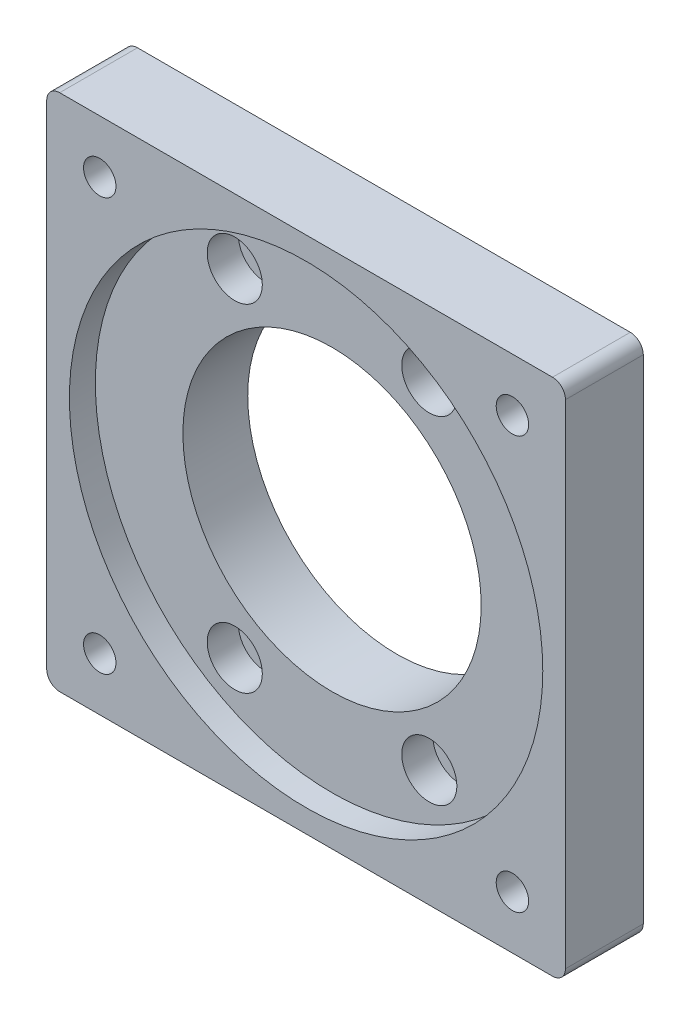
from build123d import *

# Parameters (mm, degrees)
SKETCH_1_W             = 80
SKETCH_1_H             = 80
SKETCH_1_R             = 23
EXTRUDE_1_DEPTH        = 12
SKETCH_2_R             = 2.1
CUT_EXTRUDE_1_DEPTH    = 58.827329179
SKETCH_3_R             = 36.5
CUT_EXTRUDE_2_DEPTH    = 4
SKETCH_5_R             = 2.25
CUT_EXTRUDE_3_DEPTH    = 58.131427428
SKETCH_6_R             = 4.25
CUT_EXTRUDE_4_DEPTH    = 4.8
FILLET_1_R             = 2
EXTRUDE_START          = 2
SKETCH_7_R             = 25
SKETCH_7_R_2           = 23
EXTRUDE_2_DEPTH        = 2
HOLE_WIZARD_M6_1_D     = 5
HOLE_WIZARD_M6_1_DEPTH = 15
HOLE_WIZARD_M6_1_TIP   = 1.502151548


with BuildPart() as part:
    # Sketch 1 → Extrude 1 (new body)
    with BuildSketch(Plane.XY):
        Rectangle(SKETCH_1_W, SKETCH_1_H)
        Circle(SKETCH_1_R, mode=Mode.SUBTRACT)
    extrude(amount=EXTRUDE_1_DEPTH)

    # Sketch 2 → Cut-Extrude 1 (cut, through all)
    with BuildSketch(Plane.XY.offset(12)):
        with Locations((-31.819805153, 31.819805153)):
            Circle(SKETCH_2_R)
        with Locations((31.819805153, 31.819805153)):
            Circle(SKETCH_2_R)
        with Locations((31.819805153, -31.819805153)):
            Circle(SKETCH_2_R)
        with Locations((-31.819805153, -31.819805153)):
            Circle(SKETCH_2_R)
    extrude(amount=-CUT_EXTRUDE_1_DEPTH, mode=Mode.SUBTRACT)

    # Sketch 3 → Cut-Extrude 2 (cut)
    with BuildSketch(Plane.XY.offset(12)):
        Circle(SKETCH_3_R)
    extrude(amount=-CUT_EXTRUDE_2_DEPTH, mode=Mode.SUBTRACT)

    # Sketch 5 → Cut-Extrude 3 (cut, through all)
    with BuildSketch(Plane.XY.offset(8)):
        with Locations((-15, 25.980762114)):
            Circle(SKETCH_5_R)
        with Locations((15, 25.980762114)):
            Circle(SKETCH_5_R)
        with Locations((15, -25.980762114)):
            Circle(SKETCH_5_R)
        with Locations((-15, -25.980762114)):
            Circle(SKETCH_5_R)
    extrude(amount=-CUT_EXTRUDE_3_DEPTH, mode=Mode.SUBTRACT)

    # Sketch 6 → Cut-Extrude 4 (cut)
    with BuildSketch(Plane.XY.offset(8)):
        with Locations((-15, 25.980762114)):
            Circle(SKETCH_6_R)
        with Locations((15, 25.980762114)):
            Circle(SKETCH_6_R)
        with Locations((15, -25.980762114)):
            Circle(SKETCH_6_R)
        with Locations((-15, -25.980762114)):
            Circle(SKETCH_6_R)
    extrude(amount=-CUT_EXTRUDE_4_DEPTH, mode=Mode.SUBTRACT)

    # Fillet 1
    fillet_1_edges = [part.edges().sort_by_distance(p)[0] for p in [
        (40, -40, 6),
        (-40, -40, 6),
        (-40, 40, 6),
        (40, 40, 6),
    ]]
    fillet(fillet_1_edges, radius=FILLET_1_R)

    # Sketch 7 → Extrude 2 (add)
    with BuildSketch(Plane(origin=(0, 0, 0), x_dir=(-1, 0, 0), z_dir=(0, 0, -1)).offset(EXTRUDE_START)):
        Circle(SKETCH_7_R)
        Circle(SKETCH_7_R_2, mode=Mode.SUBTRACT)
    extrude(amount=-EXTRUDE_2_DEPTH)

    # Hole Wizard M6 _1
    with Locations(Plane.XY.offset(12)):
        with Locations((-31.819805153, 31.819805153), (31.819805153, 31.819805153), (31.819805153, -31.819805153), (-31.819805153, -31.819805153)):
            Hole(HOLE_WIZARD_M6_1_D / 2, depth=HOLE_WIZARD_M6_1_DEPTH)
            with Locations((0, 0, -(HOLE_WIZARD_M6_1_DEPTH + HOLE_WIZARD_M6_1_TIP / 2))):  # 118° drill point
                Cone(0, HOLE_WIZARD_M6_1_D / 2, HOLE_WIZARD_M6_1_TIP, mode=Mode.SUBTRACT)


solid = part.part
